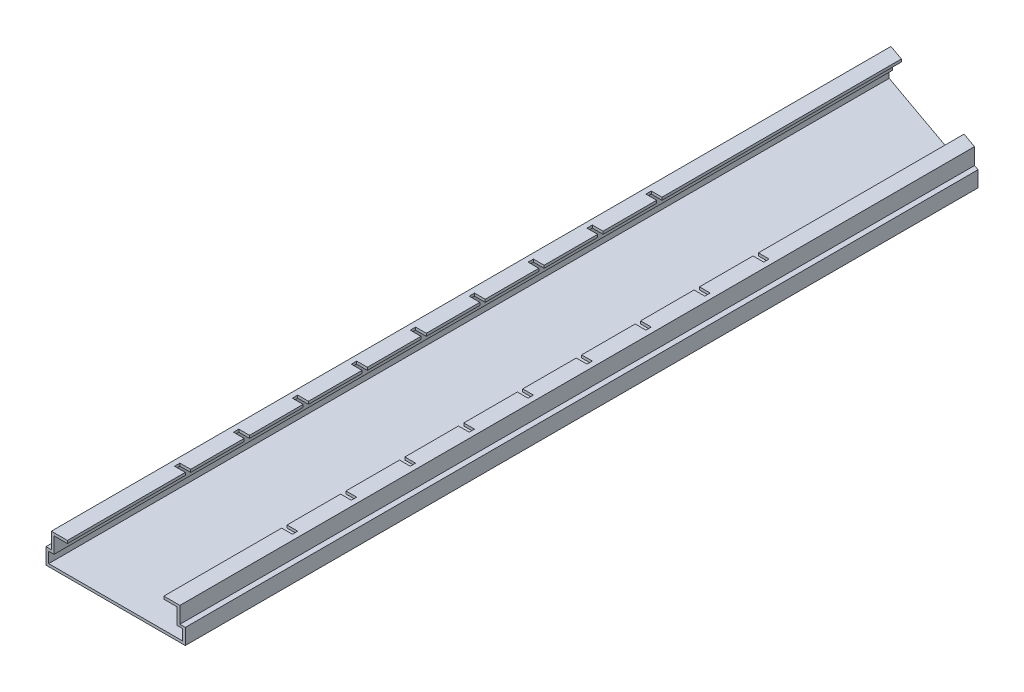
from build123d import *

# Parameters (mm, degrees)
BOSS_EXTRU_1_DEPTH      = 0.5
BOSS_EXTRU_2_REACH      = 159.638
BOSS_EXTRU_3_REACH      = 159.751
ENL_V_MAT_EXTRU_1_REACH = 159.751
ESQUISSE4_W             = 2
ESQUISSE4_H             = 1


with BuildPart() as part:
    # Esquisse1 → Boss.-Extru.1 (new body)
    with BuildSketch(Plane(origin=(0, 0, 0), x_dir=(1, 0, 0), z_dir=(0, 1, 0))):
        Polygon((13, 0), (13, 148), (-13, 157.1), (-13, 0), align=None)
    extrude(amount=BOSS_EXTRU_1_DEPTH)

    # Boss.-Extru.2: up to this plane
    boss_extru_2_end = Plane(origin=(47.565701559, 0.5, -135.902004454), z_dir=(0.330350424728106, 0, -0.9438583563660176))
    # Esquisse3 → Boss.-Extru.2 (add, up to the surface)
    with BuildSketch(Plane.XY, mode=Mode.PRIVATE) as boss_extru_2_sk1:
        Polygon((12, 6), (9, 6), (9, 5.5), (11.5, 5.5), (11.5, 2.5), (12.5, 2.5), (12.5, 0.5), (13, 0.5), (13, 2.939399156), (12, 2.939399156), (12, 3), align=None)
    boss_extru_2_tool1 = split(extrude(boss_extru_2_sk1.sketch, amount=-BOSS_EXTRU_2_REACH, mode=Mode.PRIVATE), bisect_by=boss_extru_2_end, keep=Keep.BOTH, mode=Mode.PRIVATE)
    add(boss_extru_2_tool1.solids().sort_by_distance((11.627134, 3.901436, 0))[0])

    # Boss.-Extru.3: up to this plane
    boss_extru_3_end = Plane(origin=(47.565701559, 0.5, -135.902004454), z_dir=(0.330350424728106, 0, -0.9438583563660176))
    # Esquisse5 → Boss.-Extru.3 (add, up to the surface)
    with BuildSketch(Plane.XY, mode=Mode.PRIVATE) as boss_extru_3_sk1:
        Polygon((-9, 6), (-12, 6), (-12, 3), (-13, 3), (-13, 0.5), (-12.5, 0.5), (-12.5, 2.5), (-11.5, 2.5), (-11.5, 5.5), (-9, 5.5), align=None)
    boss_extru_3_tool1 = split(extrude(boss_extru_3_sk1.sketch, amount=-BOSS_EXTRU_3_REACH, mode=Mode.PRIVATE), bisect_by=boss_extru_3_end, keep=Keep.BOTH, mode=Mode.PRIVATE)
    add(boss_extru_3_tool1.solids().sort_by_distance((-11.638889, 3.888889, 0))[0])

    # Esquisse4 → Enl_v. mat.-Extru.1 (cut, up to next)
    with BuildSketch(Plane(origin=(0, 6, 0), x_dir=(1, 0, 0), z_dir=(0, 1, 0)), mode=Mode.PRIVATE) as enl_v_mat_extru_1_sk1:
        with Locations((-10, 33.5)):
            Rectangle(ESQUISSE4_W, ESQUISSE4_H)
    enl_v_mat_extru_1_tool1 = extrude(enl_v_mat_extru_1_sk1.sketch, amount=-ENL_V_MAT_EXTRU_1_REACH, mode=Mode.PRIVATE) & part.part
    # Esquisse4 → Enl_v. mat.-Extru.1 (cut, up to next)
    with BuildSketch(Plane(origin=(0, 6, 0), x_dir=(1, 0, 0), z_dir=(0, 1, 0)), mode=Mode.PRIVATE) as enl_v_mat_extru_1_sk2:
        with Locations((-10, 22.5)):
            Rectangle(ESQUISSE4_W, ESQUISSE4_H)
    enl_v_mat_extru_1_tool2 = extrude(enl_v_mat_extru_1_sk2.sketch, amount=-ENL_V_MAT_EXTRU_1_REACH, mode=Mode.PRIVATE) & part.part
    # Esquisse4 → Enl_v. mat.-Extru.1 (cut, up to next)
    with BuildSketch(Plane(origin=(0, 6, 0), x_dir=(1, 0, 0), z_dir=(0, 1, 0)), mode=Mode.PRIVATE) as enl_v_mat_extru_1_sk3:
        with Locations((-10, 44.5)):
            Rectangle(ESQUISSE4_W, ESQUISSE4_H)
    enl_v_mat_extru_1_tool3 = extrude(enl_v_mat_extru_1_sk3.sketch, amount=-ENL_V_MAT_EXTRU_1_REACH, mode=Mode.PRIVATE) & part.part
    # Esquisse4 → Enl_v. mat.-Extru.1 (cut, up to next)
    with BuildSketch(Plane(origin=(0, 6, 0), x_dir=(1, 0, 0), z_dir=(0, 1, 0)), mode=Mode.PRIVATE) as enl_v_mat_extru_1_sk4:
        with Locations((-10, 55.5)):
            Rectangle(ESQUISSE4_W, ESQUISSE4_H)
    enl_v_mat_extru_1_tool4 = extrude(enl_v_mat_extru_1_sk4.sketch, amount=-ENL_V_MAT_EXTRU_1_REACH, mode=Mode.PRIVATE) & part.part
    # Esquisse4 → Enl_v. mat.-Extru.1 (cut, up to next)
    with BuildSketch(Plane(origin=(0, 6, 0), x_dir=(1, 0, 0), z_dir=(0, 1, 0)), mode=Mode.PRIVATE) as enl_v_mat_extru_1_sk5:
        with Locations((-10, 66.5)):
            Rectangle(ESQUISSE4_W, ESQUISSE4_H)
    enl_v_mat_extru_1_tool5 = extrude(enl_v_mat_extru_1_sk5.sketch, amount=-ENL_V_MAT_EXTRU_1_REACH, mode=Mode.PRIVATE) & part.part
    # Esquisse4 → Enl_v. mat.-Extru.1 (cut, up to next)
    with BuildSketch(Plane(origin=(0, 6, 0), x_dir=(1, 0, 0), z_dir=(0, 1, 0)), mode=Mode.PRIVATE) as enl_v_mat_extru_1_sk6:
        with Locations((-10, 77.5)):
            Rectangle(ESQUISSE4_W, ESQUISSE4_H)
    enl_v_mat_extru_1_tool6 = extrude(enl_v_mat_extru_1_sk6.sketch, amount=-ENL_V_MAT_EXTRU_1_REACH, mode=Mode.PRIVATE) & part.part
    # Esquisse4 → Enl_v. mat.-Extru.1 (cut, up to next)
    with BuildSketch(Plane(origin=(0, 6, 0), x_dir=(1, 0, 0), z_dir=(0, 1, 0)), mode=Mode.PRIVATE) as enl_v_mat_extru_1_sk7:
        with Locations((-10, 110.5)):
            Rectangle(ESQUISSE4_W, ESQUISSE4_H)
    enl_v_mat_extru_1_tool7 = extrude(enl_v_mat_extru_1_sk7.sketch, amount=-ENL_V_MAT_EXTRU_1_REACH, mode=Mode.PRIVATE) & part.part
    # Esquisse4 → Enl_v. mat.-Extru.1 (cut, up to next)
    with BuildSketch(Plane(origin=(0, 6, 0), x_dir=(1, 0, 0), z_dir=(0, 1, 0)), mode=Mode.PRIVATE) as enl_v_mat_extru_1_sk8:
        with Locations((-10, 88.5)):
            Rectangle(ESQUISSE4_W, ESQUISSE4_H)
    enl_v_mat_extru_1_tool8 = extrude(enl_v_mat_extru_1_sk8.sketch, amount=-ENL_V_MAT_EXTRU_1_REACH, mode=Mode.PRIVATE) & part.part
    # Esquisse4 → Enl_v. mat.-Extru.1 (cut, up to next)
    with BuildSketch(Plane(origin=(0, 6, 0), x_dir=(1, 0, 0), z_dir=(0, 1, 0)), mode=Mode.PRIVATE) as enl_v_mat_extru_1_sk9:
        with Locations((-10, 99.5)):
            Rectangle(ESQUISSE4_W, ESQUISSE4_H)
    enl_v_mat_extru_1_tool9 = extrude(enl_v_mat_extru_1_sk9.sketch, amount=-ENL_V_MAT_EXTRU_1_REACH, mode=Mode.PRIVATE) & part.part
    enl_v_mat_extru_1_1 = enl_v_mat_extru_1_tool1.solids().sort_by_distance((-10, 6, -33.5))[0]
    add(enl_v_mat_extru_1_1, mode=Mode.SUBTRACT)
    enl_v_mat_extru_1_2 = enl_v_mat_extru_1_tool2.solids().sort_by_distance((-10, 6, -22.5))[0]
    add(enl_v_mat_extru_1_2, mode=Mode.SUBTRACT)
    enl_v_mat_extru_1_3 = enl_v_mat_extru_1_tool3.solids().sort_by_distance((-10, 6, -44.5))[0]
    add(enl_v_mat_extru_1_3, mode=Mode.SUBTRACT)
    enl_v_mat_extru_1_4 = enl_v_mat_extru_1_tool4.solids().sort_by_distance((-10, 6, -55.5))[0]
    add(enl_v_mat_extru_1_4, mode=Mode.SUBTRACT)
    enl_v_mat_extru_1_5 = enl_v_mat_extru_1_tool5.solids().sort_by_distance((-10, 6, -66.5))[0]
    add(enl_v_mat_extru_1_5, mode=Mode.SUBTRACT)
    enl_v_mat_extru_1_6 = enl_v_mat_extru_1_tool6.solids().sort_by_distance((-10, 6, -77.5))[0]
    add(enl_v_mat_extru_1_6, mode=Mode.SUBTRACT)
    enl_v_mat_extru_1_7 = enl_v_mat_extru_1_tool7.solids().sort_by_distance((-10, 6, -110.5))[0]
    add(enl_v_mat_extru_1_7, mode=Mode.SUBTRACT)
    enl_v_mat_extru_1_8 = enl_v_mat_extru_1_tool8.solids().sort_by_distance((-10, 6, -88.5))[0]
    add(enl_v_mat_extru_1_8, mode=Mode.SUBTRACT)
    enl_v_mat_extru_1_9 = enl_v_mat_extru_1_tool9.solids().sort_by_distance((-10, 6, -99.5))[0]
    add(enl_v_mat_extru_1_9, mode=Mode.SUBTRACT)
    enl_v_mat_extru_1 = enl_v_mat_extru_1_1 + enl_v_mat_extru_1_2 + enl_v_mat_extru_1_3 + enl_v_mat_extru_1_4 + enl_v_mat_extru_1_5 + enl_v_mat_extru_1_6 + enl_v_mat_extru_1_7 + enl_v_mat_extru_1_8 + enl_v_mat_extru_1_9  # Enl_v. mat.-Extru.1 as one shape, for the pattern or mirror that repeats it

    # Sym_trie1: Enl_v. mat.-Extru.1 across plane
    add(enl_v_mat_extru_1.mirror(Plane(origin=(0, 0, 0), x_dir=(0, 0, 1), z_dir=(1, 0, 0))), mode=Mode.SUBTRACT)


solid = part.part
